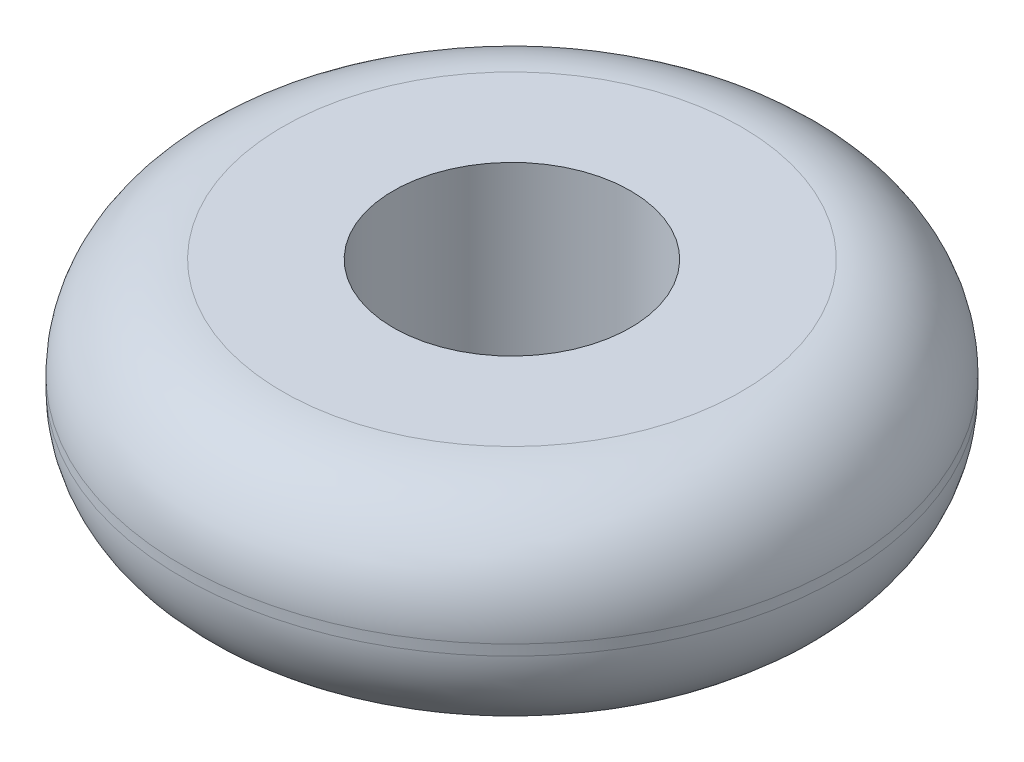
ISO-10303-21;
HEADER;
FILE_DESCRIPTION(('STEP AP214'),'2;1');
FILE_NAME('part.step','',(''),(''),'','','');
FILE_SCHEMA(('AUTOMOTIVE_DESIGN { 1 0 10303 214 1 1 1 1 }'));
ENDSEC;
DATA;
#1=APPLICATION_CONTEXT('core data for automotive mechanical design processes');
#2=APPLICATION_PROTOCOL_DEFINITION('international standard','automotive_design',2000,#1);
#3=PRODUCT_CONTEXT('',#1,'mechanical');
#4=PRODUCT('Part','Part','',(#3));
#5=PRODUCT_RELATED_PRODUCT_CATEGORY('part','',(#4));
#6=PRODUCT_DEFINITION_FORMATION('','',#4);
#7=PRODUCT_DEFINITION_CONTEXT('part definition',#1,'design');
#8=PRODUCT_DEFINITION('design','',#6,#7);
#9=PRODUCT_DEFINITION_SHAPE('','',#8);
#10=(LENGTH_UNIT() NAMED_UNIT(*) SI_UNIT(.MILLI.,.METRE.));
#11=(NAMED_UNIT(*) PLANE_ANGLE_UNIT() SI_UNIT($,.RADIAN.));
#12=(NAMED_UNIT(*) SI_UNIT($,.STERADIAN.) SOLID_ANGLE_UNIT());
#13=UNCERTAINTY_MEASURE_WITH_UNIT(LENGTH_MEASURE(1.E-05),#10,'distance_accuracy_value','');
#14=(GEOMETRIC_REPRESENTATION_CONTEXT(3) GLOBAL_UNCERTAINTY_ASSIGNED_CONTEXT((#13)) GLOBAL_UNIT_ASSIGNED_CONTEXT((#10,
#11,#12)) REPRESENTATION_CONTEXT('',''));
#15=CARTESIAN_POINT('',(0.,0.,0.));
#16=DIRECTION('',(0.,0.,1.));
#17=DIRECTION('',(1.,0.,0.));
#18=AXIS2_PLACEMENT_3D('',#15,#16,#17);
#19=CARTESIAN_POINT('',(0.,3.8,0.));
#20=DIRECTION('',(0.,-1.,0.));
#21=DIRECTION('',(0.,0.,-1.));
#22=AXIS2_PLACEMENT_3D('',#19,#20,#21);
#23=TOROIDAL_SURFACE('',#22,8.7,3.8);
#24=CARTESIAN_POINT('',(0.,0.,0.));
#25=DIRECTION('',(0.,-1.,0.));
#26=DIRECTION('',(0.,0.,-1.));
#27=AXIS2_PLACEMENT_3D('',#24,#25,#26);
#28=CIRCLE('',#27,8.7);
#29=CARTESIAN_POINT('',(0.,0.,-8.7));
#30=VERTEX_POINT('',#29);
#31=EDGE_CURVE('E12',#30,#30,#28,.T.);
#32=ORIENTED_EDGE('',*,*,#31,.F.);
#33=EDGE_LOOP('',(#32));
#34=FACE_BOUND('',#33,.T.);
#35=CARTESIAN_POINT('',(0.,3.8,0.));
#36=DIRECTION('',(0.,-1.,0.));
#37=DIRECTION('',(0.,0.,-1.));
#38=AXIS2_PLACEMENT_3D('',#35,#36,#37);
#39=CIRCLE('',#38,12.5);
#40=CARTESIAN_POINT('',(0.,3.8,-12.5));
#41=VERTEX_POINT('',#40);
#42=EDGE_CURVE('E62',#41,#41,#39,.T.);
#43=ORIENTED_EDGE('',*,*,#42,.T.);
#44=EDGE_LOOP('',(#43));
#45=FACE_BOUND('',#44,.T.);
#46=ADVANCED_FACE('F40',(#34,#45),#23,.T.);
#47=CARTESIAN_POINT('',(-4.5,0.,0.));
#48=DIRECTION('',(0.,1.,0.));
#49=DIRECTION('',(0.,0.,1.));
#50=AXIS2_PLACEMENT_3D('',#47,#48,#49);
#51=PLANE('',#50);
#52=CARTESIAN_POINT('',(0.,0.,0.));
#53=DIRECTION('',(0.,-1.,0.));
#54=DIRECTION('',(0.,0.,-1.));
#55=AXIS2_PLACEMENT_3D('',#52,#53,#54);
#56=CIRCLE('',#55,4.5);
#57=CARTESIAN_POINT('',(0.,0.,-4.5));
#58=VERTEX_POINT('',#57);
#59=EDGE_CURVE('E46',#58,#58,#56,.T.);
#60=ORIENTED_EDGE('',*,*,#59,.F.);
#61=EDGE_LOOP('',(#60));
#62=FACE_BOUND('',#61,.T.);
#63=ORIENTED_EDGE('',*,*,#31,.T.);
#64=EDGE_LOOP('',(#63));
#65=FACE_BOUND('',#64,.T.);
#66=ADVANCED_FACE('F87',(#62,#65),#51,.F.);
#67=CARTESIAN_POINT('',(0.,0.,0.));
#68=DIRECTION('',(0.,-1.,0.));
#69=DIRECTION('',(0.,0.,-1.));
#70=AXIS2_PLACEMENT_3D('',#67,#68,#69);
#71=CYLINDRICAL_SURFACE('',#70,4.5);
#72=CARTESIAN_POINT('',(0.,8.,0.));
#73=DIRECTION('',(0.,-1.,0.));
#74=DIRECTION('',(0.,0.,-1.));
#75=AXIS2_PLACEMENT_3D('',#72,#73,#74);
#76=CIRCLE('',#75,4.5);
#77=CARTESIAN_POINT('',(0.,8.,-4.5));
#78=VERTEX_POINT('',#77);
#79=EDGE_CURVE('E50',#78,#78,#76,.T.);
#80=ORIENTED_EDGE('',*,*,#79,.F.);
#81=EDGE_LOOP('',(#80));
#82=FACE_BOUND('',#81,.T.);
#83=ORIENTED_EDGE('',*,*,#59,.T.);
#84=EDGE_LOOP('',(#83));
#85=FACE_BOUND('',#84,.T.);
#86=ADVANCED_FACE('F82',(#82,#85),#71,.F.);
#87=CARTESIAN_POINT('',(-8.7,8.,0.));
#88=DIRECTION('',(0.,-1.,0.));
#89=DIRECTION('',(0.,0.,-1.));
#90=AXIS2_PLACEMENT_3D('',#87,#88,#89);
#91=PLANE('',#90);
#92=CARTESIAN_POINT('',(0.,8.,0.));
#93=DIRECTION('',(0.,-1.,0.));
#94=DIRECTION('',(0.,0.,-1.));
#95=AXIS2_PLACEMENT_3D('',#92,#93,#94);
#96=CIRCLE('',#95,8.7);
#97=CARTESIAN_POINT('',(0.,8.,-8.7));
#98=VERTEX_POINT('',#97);
#99=EDGE_CURVE('E54',#98,#98,#96,.T.);
#100=ORIENTED_EDGE('',*,*,#99,.F.);
#101=EDGE_LOOP('',(#100));
#102=FACE_BOUND('',#101,.T.);
#103=ORIENTED_EDGE('',*,*,#79,.T.);
#104=EDGE_LOOP('',(#103));
#105=FACE_BOUND('',#104,.T.);
#106=ADVANCED_FACE('F76',(#102,#105),#91,.F.);
#107=CARTESIAN_POINT('',(0.,4.2,0.));
#108=DIRECTION('',(0.,-1.,0.));
#109=DIRECTION('',(0.,0.,-1.));
#110=AXIS2_PLACEMENT_3D('',#107,#108,#109);
#111=TOROIDAL_SURFACE('',#110,8.7,3.8);
#112=CARTESIAN_POINT('',(0.,4.2,0.));
#113=DIRECTION('',(0.,-1.,0.));
#114=DIRECTION('',(0.,0.,-1.));
#115=AXIS2_PLACEMENT_3D('',#112,#113,#114);
#116=CIRCLE('',#115,12.5);
#117=CARTESIAN_POINT('',(0.,4.2,-12.5));
#118=VERTEX_POINT('',#117);
#119=EDGE_CURVE('E59',#118,#118,#116,.T.);
#120=ORIENTED_EDGE('',*,*,#119,.F.);
#121=EDGE_LOOP('',(#120));
#122=FACE_BOUND('',#121,.T.);
#123=ORIENTED_EDGE('',*,*,#99,.T.);
#124=EDGE_LOOP('',(#123));
#125=FACE_BOUND('',#124,.T.);
#126=ADVANCED_FACE('F70',(#122,#125),#111,.T.);
#127=CARTESIAN_POINT('',(0.,0.,0.));
#128=DIRECTION('',(0.,-1.,0.));
#129=DIRECTION('',(0.,0.,-1.));
#130=AXIS2_PLACEMENT_3D('',#127,#128,#129);
#131=CYLINDRICAL_SURFACE('',#130,12.5);
#132=ORIENTED_EDGE('',*,*,#42,.F.);
#133=EDGE_LOOP('',(#132));
#134=FACE_BOUND('',#133,.T.);
#135=ORIENTED_EDGE('',*,*,#119,.T.);
#136=EDGE_LOOP('',(#135));
#137=FACE_BOUND('',#136,.T.);
#138=ADVANCED_FACE('F67',(#134,#137),#131,.T.);
#139=CLOSED_SHELL('',(#46,#66,#86,#106,#126,#138));
#140=MANIFOLD_SOLID_BREP('B2',#139);
#141=ADVANCED_BREP_SHAPE_REPRESENTATION('',(#18,#140),#14);
#142=SHAPE_DEFINITION_REPRESENTATION(#9,#141);
ENDSEC;
END-ISO-10303-21;
